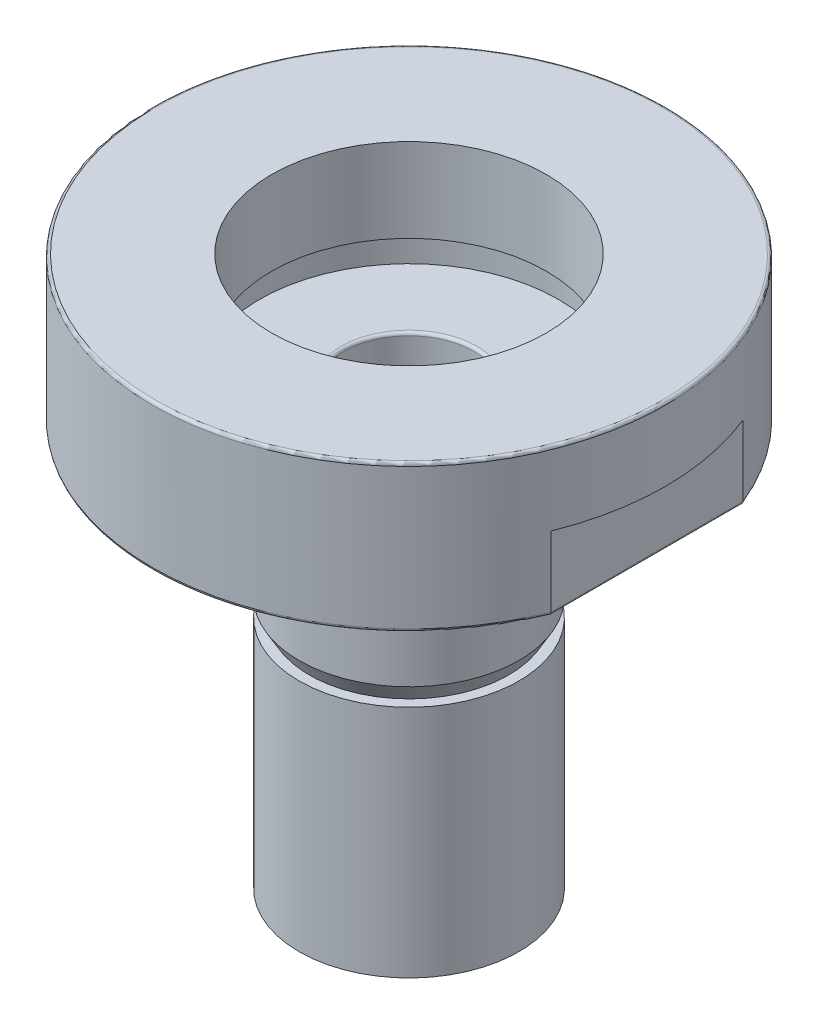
ISO-10303-21;
HEADER;
FILE_DESCRIPTION(('STEP AP214'),'2;1');
FILE_NAME('part.step','',(''),(''),'','','');
FILE_SCHEMA(('AUTOMOTIVE_DESIGN { 1 0 10303 214 1 1 1 1 }'));
ENDSEC;
DATA;
#1=APPLICATION_CONTEXT('core data for automotive mechanical design processes');
#2=APPLICATION_PROTOCOL_DEFINITION('international standard','automotive_design',2000,#1);
#3=PRODUCT_CONTEXT('',#1,'mechanical');
#4=PRODUCT('Part','Part','',(#3));
#5=PRODUCT_RELATED_PRODUCT_CATEGORY('part','',(#4));
#6=PRODUCT_DEFINITION_FORMATION('','',#4);
#7=PRODUCT_DEFINITION_CONTEXT('part definition',#1,'design');
#8=PRODUCT_DEFINITION('design','',#6,#7);
#9=PRODUCT_DEFINITION_SHAPE('','',#8);
#10=(LENGTH_UNIT() NAMED_UNIT(*) SI_UNIT(.MILLI.,.METRE.));
#11=(NAMED_UNIT(*) PLANE_ANGLE_UNIT() SI_UNIT($,.RADIAN.));
#12=(NAMED_UNIT(*) SI_UNIT($,.STERADIAN.) SOLID_ANGLE_UNIT());
#13=UNCERTAINTY_MEASURE_WITH_UNIT(LENGTH_MEASURE(1.E-05),#10,'distance_accuracy_value','');
#14=(GEOMETRIC_REPRESENTATION_CONTEXT(3) GLOBAL_UNCERTAINTY_ASSIGNED_CONTEXT((#13)) GLOBAL_UNIT_ASSIGNED_CONTEXT((#10,
#11,#12)) REPRESENTATION_CONTEXT('',''));
#15=CARTESIAN_POINT('',(0.,0.,0.));
#16=DIRECTION('',(0.,0.,1.));
#17=DIRECTION('',(1.,0.,0.));
#18=AXIS2_PLACEMENT_3D('',#15,#16,#17);
#19=CARTESIAN_POINT('',(0.,38.6460191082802,0.));
#20=DIRECTION('',(0.,1.,0.));
#21=DIRECTION('',(0.,0.,1.));
#22=AXIS2_PLACEMENT_3D('',#19,#20,#21);
#23=CYLINDRICAL_SURFACE('',#22,9.525);
#24=CARTESIAN_POINT('',(0.,-34.925,0.));
#25=DIRECTION('',(0.,1.,0.));
#26=DIRECTION('',(0.,0.,1.));
#27=AXIS2_PLACEMENT_3D('',#24,#25,#26);
#28=CIRCLE('',#27,9.52499999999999);
#29=CARTESIAN_POINT('',(0.,-34.925,9.52499999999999));
#30=VERTEX_POINT('',#29);
#31=EDGE_CURVE('E138',#30,#30,#28,.T.);
#32=ORIENTED_EDGE('',*,*,#31,.T.);
#33=EDGE_LOOP('',(#32));
#34=FACE_BOUND('',#33,.T.);
#35=CARTESIAN_POINT('',(0.,-14.605,0.));
#36=DIRECTION('',(0.,1.,0.));
#37=DIRECTION('',(0.,0.,1.));
#38=AXIS2_PLACEMENT_3D('',#35,#36,#37);
#39=CIRCLE('',#38,9.525);
#40=CARTESIAN_POINT('',(0.,-14.605,9.525));
#41=VERTEX_POINT('',#40);
#42=EDGE_CURVE('E40',#41,#41,#39,.F.);
#43=ORIENTED_EDGE('',*,*,#42,.T.);
#44=EDGE_LOOP('',(#43));
#45=FACE_BOUND('',#44,.T.);
#46=ADVANCED_FACE('F36',(#34,#45),#23,.T.);
#47=CARTESIAN_POINT('',(0.,-3.429,0.));
#48=DIRECTION('',(0.,-1.,0.));
#49=DIRECTION('',(0.,0.,-1.));
#50=AXIS2_PLACEMENT_3D('',#47,#48,#49);
#51=CIRCLE('',#50,9.525);
#52=CARTESIAN_POINT('',(0.,-3.429,-9.525));
#53=VERTEX_POINT('',#52);
#54=EDGE_CURVE('E203',#53,#53,#51,.T.);
#55=ORIENTED_EDGE('',*,*,#54,.T.);
#56=EDGE_LOOP('',(#55));
#57=FACE_BOUND('',#56,.T.);
#58=CARTESIAN_POINT('',(0.,-13.0696062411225,0.));
#59=DIRECTION('',(0.,-1.,0.));
#60=DIRECTION('',(0.,0.,-1.));
#61=AXIS2_PLACEMENT_3D('',#58,#59,#60);
#62=CIRCLE('',#61,9.525);
#63=CARTESIAN_POINT('',(0.,-13.0696062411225,-9.525));
#64=VERTEX_POINT('',#63);
#65=EDGE_CURVE('E673',#64,#64,#62,.T.);
#66=ORIENTED_EDGE('',*,*,#65,.F.);
#67=EDGE_LOOP('',(#66));
#68=FACE_BOUND('',#67,.T.);
#69=ADVANCED_FACE('F278',(#57,#68),#23,.T.);
#70=CARTESIAN_POINT('',(0.,0.,22.225));
#71=DIRECTION('',(0.,-1.,0.));
#72=DIRECTION('',(0.,0.,-1.));
#73=AXIS2_PLACEMENT_3D('',#70,#71,#72);
#74=PLANE('',#73);
#75=CARTESIAN_POINT('',(0.,0.,0.));
#76=DIRECTION('',(0.,-1.,0.));
#77=DIRECTION('',(0.,0.,-1.));
#78=AXIS2_PLACEMENT_3D('',#75,#76,#77);
#79=CIRCLE('',#78,21.971);
#80=CARTESIAN_POINT('',(-20.3581,0.,-8.26272384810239));
#81=VERTEX_POINT('',#80);
#82=CARTESIAN_POINT('',(20.3581,0.,-8.26272384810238));
#83=VERTEX_POINT('',#82);
#84=EDGE_CURVE('E176',#81,#83,#79,.T.);
#85=ORIENTED_EDGE('',*,*,#84,.T.);
#86=DIRECTION('',(0.,0.,-1.));
#87=VECTOR('',#86,1.);
#88=CARTESIAN_POINT('',(20.3581,0.,8.31215727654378));
#89=LINE('',#88,#87);
#90=CARTESIAN_POINT('',(20.3581,0.,8.26272384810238));
#91=VERTEX_POINT('',#90);
#92=EDGE_CURVE('E181',#83,#91,#89,.F.);
#93=ORIENTED_EDGE('',*,*,#92,.T.);
#94=CARTESIAN_POINT('',(0.,0.,0.));
#95=DIRECTION('',(0.,-1.,0.));
#96=DIRECTION('',(0.,0.,-1.));
#97=AXIS2_PLACEMENT_3D('',#94,#95,#96);
#98=CIRCLE('',#97,21.971);
#99=CARTESIAN_POINT('',(-20.3581,0.,8.26272384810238));
#100=VERTEX_POINT('',#99);
#101=EDGE_CURVE('E60',#91,#100,#98,.T.);
#102=ORIENTED_EDGE('',*,*,#101,.T.);
#103=DIRECTION('',(0.,0.,1.));
#104=VECTOR('',#103,1.);
#105=CARTESIAN_POINT('',(-20.3581,0.,-8.31215727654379));
#106=LINE('',#105,#104);
#107=EDGE_CURVE('E178',#100,#81,#106,.F.);
#108=ORIENTED_EDGE('',*,*,#107,.T.);
#109=EDGE_LOOP('',(#85,#93,#102,#108));
#110=FACE_BOUND('',#109,.T.);
#111=CARTESIAN_POINT('',(0.,0.,0.));
#112=DIRECTION('',(0.,-1.,0.));
#113=DIRECTION('',(0.,0.,-1.));
#114=AXIS2_PLACEMENT_3D('',#111,#112,#113);
#115=CIRCLE('',#114,17.8308);
#116=CARTESIAN_POINT('',(0.,0.,-17.8308));
#117=VERTEX_POINT('',#116);
#118=EDGE_CURVE('E147',#117,#117,#115,.F.);
#119=ORIENTED_EDGE('',*,*,#118,.T.);
#120=EDGE_LOOP('',(#119));
#121=FACE_BOUND('',#120,.T.);
#122=ADVANCED_FACE('F284',(#110,#121),#74,.T.);
#123=CARTESIAN_POINT('',(0.,0.,0.));
#124=DIRECTION('',(0.,-1.,0.));
#125=DIRECTION('',(0.,0.,-1.));
#126=AXIS2_PLACEMENT_3D('',#123,#124,#125);
#127=CIRCLE('',#126,8.80491);
#128=CARTESIAN_POINT('',(0.,0.,-8.80491));
#129=VERTEX_POINT('',#128);
#130=EDGE_CURVE('E11',#129,#129,#127,.F.);
#131=ORIENTED_EDGE('',*,*,#130,.T.);
#132=EDGE_LOOP('',(#131));
#133=FACE_BOUND('',#132,.T.);
#134=CARTESIAN_POINT('',(0.,0.,0.));
#135=DIRECTION('',(0.,-1.,0.));
#136=DIRECTION('',(0.,0.,-1.));
#137=AXIS2_PLACEMENT_3D('',#134,#135,#136);
#138=CIRCLE('',#137,14.6812);
#139=CARTESIAN_POINT('',(0.,0.,-14.6812));
#140=VERTEX_POINT('',#139);
#141=EDGE_CURVE('E150',#140,#140,#138,.T.);
#142=ORIENTED_EDGE('',*,*,#141,.T.);
#143=EDGE_LOOP('',(#142));
#144=FACE_BOUND('',#143,.T.);
#145=ADVANCED_FACE('F293',(#133,#144),#74,.T.);
#146=CARTESIAN_POINT('',(0.,2.794,0.));
#147=DIRECTION('',(0.,1.,0.));
#148=DIRECTION('',(0.,0.,1.));
#149=AXIS2_PLACEMENT_3D('',#146,#147,#148);
#150=CYLINDRICAL_SURFACE('',#149,11.90625);
#151=CARTESIAN_POINT('',(0.,12.7,0.));
#152=DIRECTION('',(0.,1.,0.));
#153=DIRECTION('',(0.,0.,1.));
#154=AXIS2_PLACEMENT_3D('',#151,#152,#153);
#155=CIRCLE('',#154,11.90625);
#156=CARTESIAN_POINT('',(0.,12.7,11.90625));
#157=VERTEX_POINT('',#156);
#158=EDGE_CURVE('E135',#157,#157,#155,.T.);
#159=ORIENTED_EDGE('',*,*,#158,.T.);
#160=EDGE_LOOP('',(#159));
#161=FACE_BOUND('',#160,.T.);
#162=CARTESIAN_POINT('',(0.,5.4356,0.));
#163=DIRECTION('',(0.,-1.,0.));
#164=DIRECTION('',(0.,0.,-1.));
#165=AXIS2_PLACEMENT_3D('',#162,#163,#164);
#166=CIRCLE('',#165,11.90625);
#167=CARTESIAN_POINT('',(0.,5.4356,-11.90625));
#168=VERTEX_POINT('',#167);
#169=EDGE_CURVE('E132',#168,#168,#166,.T.);
#170=ORIENTED_EDGE('',*,*,#169,.T.);
#171=EDGE_LOOP('',(#170));
#172=FACE_BOUND('',#171,.T.);
#173=ADVANCED_FACE('F330',(#161,#172),#150,.F.);
#174=CARTESIAN_POINT('',(0.,12.7,0.));
#175=DIRECTION('',(0.,-1.,0.));
#176=DIRECTION('',(0.,0.,-1.));
#177=AXIS2_PLACEMENT_3D('',#174,#175,#176);
#178=CYLINDRICAL_SURFACE('',#177,5.6515);
#179=CARTESIAN_POINT('',(0.,-34.671,0.));
#180=DIRECTION('',(0.,-1.,0.));
#181=DIRECTION('',(0.,0.,-1.));
#182=AXIS2_PLACEMENT_3D('',#179,#180,#181);
#183=CIRCLE('',#182,5.6515);
#184=CARTESIAN_POINT('',(0.,-34.671,-5.6515));
#185=VERTEX_POINT('',#184);
#186=EDGE_CURVE('E188',#185,#185,#183,.T.);
#187=ORIENTED_EDGE('',*,*,#186,.T.);
#188=EDGE_LOOP('',(#187));
#189=FACE_BOUND('',#188,.T.);
#190=CARTESIAN_POINT('',(0.,2.54,0.));
#191=DIRECTION('',(0.,1.,0.));
#192=DIRECTION('',(0.,0.,1.));
#193=AXIS2_PLACEMENT_3D('',#190,#191,#192);
#194=CIRCLE('',#193,5.6515);
#195=CARTESIAN_POINT('',(0.,2.54,5.6515));
#196=VERTEX_POINT('',#195);
#197=EDGE_CURVE('E185',#196,#196,#194,.T.);
#198=ORIENTED_EDGE('',*,*,#197,.T.);
#199=EDGE_LOOP('',(#198));
#200=FACE_BOUND('',#199,.T.);
#201=ADVANCED_FACE('F300',(#189,#200),#178,.F.);
#202=CARTESIAN_POINT('',(0.,12.7,0.));
#203=DIRECTION('',(0.,1.,0.));
#204=DIRECTION('',(0.,0.,1.));
#205=AXIS2_PLACEMENT_3D('',#202,#203,#204);
#206=PLANE('',#205);
#207=CARTESIAN_POINT('',(0.,12.7,0.));
#208=DIRECTION('',(0.,1.,0.));
#209=DIRECTION('',(0.,0.,1.));
#210=AXIS2_PLACEMENT_3D('',#207,#208,#209);
#211=CIRCLE('',#210,21.971);
#212=CARTESIAN_POINT('',(0.,12.7,21.971));
#213=VERTEX_POINT('',#212);
#214=EDGE_CURVE('E165',#213,#213,#211,.T.);
#215=ORIENTED_EDGE('',*,*,#214,.T.);
#216=EDGE_LOOP('',(#215));
#217=FACE_BOUND('',#216,.T.);
#218=ORIENTED_EDGE('',*,*,#158,.F.);
#219=EDGE_LOOP('',(#218));
#220=FACE_BOUND('',#219,.T.);
#221=ADVANCED_FACE('F296',(#217,#220),#206,.T.);
#222=CARTESIAN_POINT('',(0.,38.6460191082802,0.));
#223=DIRECTION('',(0.,1.,0.));
#224=DIRECTION('',(0.,0.,1.));
#225=AXIS2_PLACEMENT_3D('',#222,#223,#224);
#226=CYLINDRICAL_SURFACE('',#225,22.225);
#227=CARTESIAN_POINT('',(0.,12.446,0.));
#228=DIRECTION('',(0.,1.,0.));
#229=DIRECTION('',(0.,0.,1.));
#230=AXIS2_PLACEMENT_3D('',#227,#228,#229);
#231=CIRCLE('',#230,22.225);
#232=CARTESIAN_POINT('',(0.,12.446,22.225));
#233=VERTEX_POINT('',#232);
#234=EDGE_CURVE('E171',#233,#233,#231,.F.);
#235=ORIENTED_EDGE('',*,*,#234,.T.);
#236=EDGE_LOOP('',(#235));
#237=FACE_BOUND('',#236,.T.);
#238=DIRECTION('',(0.,1.,0.));
#239=VECTOR('',#238,1.);
#240=CARTESIAN_POINT('',(-20.6121,38.6460191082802,8.31215727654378));
#241=LINE('',#240,#239);
#242=CARTESIAN_POINT('',(-20.6121,0.253999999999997,8.31215727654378));
#243=VERTEX_POINT('',#242);
#244=CARTESIAN_POINT('',(-20.6121,6.35,8.31215727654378));
#245=VERTEX_POINT('',#244);
#246=EDGE_CURVE('E118',#243,#245,#241,.T.);
#247=ORIENTED_EDGE('',*,*,#246,.F.);
#248=CARTESIAN_POINT('',(0.,0.253999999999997,0.));
#249=DIRECTION('',(0.,-1.,0.));
#250=DIRECTION('',(0.,0.,-1.));
#251=AXIS2_PLACEMENT_3D('',#248,#249,#250);
#252=CIRCLE('',#251,22.225);
#253=CARTESIAN_POINT('',(20.6121,0.253999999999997,8.31215727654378));
#254=VERTEX_POINT('',#253);
#255=EDGE_CURVE('E114',#243,#254,#252,.F.);
#256=ORIENTED_EDGE('',*,*,#255,.T.);
#257=DIRECTION('',(0.,1.,0.));
#258=VECTOR('',#257,1.);
#259=CARTESIAN_POINT('',(20.6121,38.6460191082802,8.31215727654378));
#260=LINE('',#259,#258);
#261=CARTESIAN_POINT('',(20.6121,6.35,8.31215727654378));
#262=VERTEX_POINT('',#261);
#263=EDGE_CURVE('E107',#262,#254,#260,.F.);
#264=ORIENTED_EDGE('',*,*,#263,.F.);
#265=CARTESIAN_POINT('',(0.,6.35,0.));
#266=DIRECTION('',(0.,1.,0.));
#267=DIRECTION('',(0.,0.,1.));
#268=AXIS2_PLACEMENT_3D('',#265,#266,#267);
#269=CIRCLE('',#268,22.225);
#270=CARTESIAN_POINT('',(20.6121,6.35,-8.31215727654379));
#271=VERTEX_POINT('',#270);
#272=EDGE_CURVE('E93',#271,#262,#269,.F.);
#273=ORIENTED_EDGE('',*,*,#272,.F.);
#274=DIRECTION('',(0.,1.,0.));
#275=VECTOR('',#274,1.);
#276=CARTESIAN_POINT('',(20.6121,38.6460191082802,-8.31215727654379));
#277=LINE('',#276,#275);
#278=CARTESIAN_POINT('',(20.6121,0.253999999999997,-8.31215727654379));
#279=VERTEX_POINT('',#278);
#280=EDGE_CURVE('E108',#279,#271,#277,.T.);
#281=ORIENTED_EDGE('',*,*,#280,.F.);
#282=CARTESIAN_POINT('',(0.,0.253999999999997,0.));
#283=DIRECTION('',(0.,-1.,0.));
#284=DIRECTION('',(0.,0.,-1.));
#285=AXIS2_PLACEMENT_3D('',#282,#283,#284);
#286=CIRCLE('',#285,22.225);
#287=CARTESIAN_POINT('',(-20.6121,0.253999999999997,-8.31215727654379));
#288=VERTEX_POINT('',#287);
#289=EDGE_CURVE('E168',#279,#288,#286,.F.);
#290=ORIENTED_EDGE('',*,*,#289,.T.);
#291=DIRECTION('',(0.,1.,0.));
#292=VECTOR('',#291,1.);
#293=CARTESIAN_POINT('',(-20.6121,38.6460191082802,-8.31215727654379));
#294=LINE('',#293,#292);
#295=CARTESIAN_POINT('',(-20.6121,6.35,-8.31215727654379));
#296=VERTEX_POINT('',#295);
#297=EDGE_CURVE('E123',#296,#288,#294,.F.);
#298=ORIENTED_EDGE('',*,*,#297,.F.);
#299=CARTESIAN_POINT('',(0.,6.35,0.));
#300=DIRECTION('',(0.,1.,0.));
#301=DIRECTION('',(0.,0.,1.));
#302=AXIS2_PLACEMENT_3D('',#299,#300,#301);
#303=CIRCLE('',#302,22.225);
#304=EDGE_CURVE('E101',#245,#296,#303,.F.);
#305=ORIENTED_EDGE('',*,*,#304,.F.);
#306=EDGE_LOOP('',(#247,#256,#264,#273,#281,#290,#298,#305));
#307=FACE_BOUND('',#306,.T.);
#308=ADVANCED_FACE('F112',(#237,#307),#226,.T.);
#309=CARTESIAN_POINT('',(0.,-34.925,9.52499999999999));
#310=DIRECTION('',(0.,-1.,0.));
#311=DIRECTION('',(0.,0.,-1.));
#312=AXIS2_PLACEMENT_3D('',#309,#310,#311);
#313=PLANE('',#312);
#314=CARTESIAN_POINT('',(0.,-34.925,0.));
#315=DIRECTION('',(0.,-1.,0.));
#316=DIRECTION('',(0.,0.,-1.));
#317=AXIS2_PLACEMENT_3D('',#314,#315,#316);
#318=CIRCLE('',#317,5.9055);
#319=CARTESIAN_POINT('',(0.,-34.925,-5.9055));
#320=VERTEX_POINT('',#319);
#321=EDGE_CURVE('E191',#320,#320,#318,.F.);
#322=ORIENTED_EDGE('',*,*,#321,.T.);
#323=EDGE_LOOP('',(#322));
#324=FACE_BOUND('',#323,.T.);
#325=ORIENTED_EDGE('',*,*,#31,.F.);
#326=EDGE_LOOP('',(#325));
#327=FACE_BOUND('',#326,.T.);
#328=ADVANCED_FACE('F289',(#324,#327),#313,.T.);
#329=CARTESIAN_POINT('',(0.,2.794,0.));
#330=DIRECTION('',(0.,1.,0.));
#331=DIRECTION('',(0.,0.,1.));
#332=AXIS2_PLACEMENT_3D('',#329,#330,#331);
#333=PLANE('',#332);
#334=CARTESIAN_POINT('',(0.,2.794,0.));
#335=DIRECTION('',(0.,1.,0.));
#336=DIRECTION('',(0.,0.,1.));
#337=AXIS2_PLACEMENT_3D('',#334,#335,#336);
#338=CIRCLE('',#337,5.9055);
#339=CARTESIAN_POINT('',(0.,2.794,5.9055));
#340=VERTEX_POINT('',#339);
#341=EDGE_CURVE('E194',#340,#340,#338,.F.);
#342=ORIENTED_EDGE('',*,*,#341,.T.);
#343=EDGE_LOOP('',(#342));
#344=FACE_BOUND('',#343,.T.);
#345=CARTESIAN_POINT('',(0.,2.794,0.));
#346=DIRECTION('',(0.,-1.,0.));
#347=DIRECTION('',(0.,0.,-1.));
#348=AXIS2_PLACEMENT_3D('',#345,#346,#347);
#349=CIRCLE('',#348,12.954);
#350=CARTESIAN_POINT('',(0.,2.794,-12.954));
#351=VERTEX_POINT('',#350);
#352=EDGE_CURVE('E126',#351,#351,#349,.T.);
#353=ORIENTED_EDGE('',*,*,#352,.F.);
#354=EDGE_LOOP('',(#353));
#355=FACE_BOUND('',#354,.T.);
#356=ADVANCED_FACE('F339',(#344,#355),#333,.T.);
#357=CARTESIAN_POINT('',(0.,5.4356,11.90625));
#358=DIRECTION('',(0.,-1.,0.));
#359=DIRECTION('',(0.,0.,-1.));
#360=AXIS2_PLACEMENT_3D('',#357,#358,#359);
#361=PLANE('',#360);
#362=CARTESIAN_POINT('',(0.,5.4356,0.));
#363=DIRECTION('',(0.,-1.,0.));
#364=DIRECTION('',(0.,0.,-1.));
#365=AXIS2_PLACEMENT_3D('',#362,#363,#364);
#366=CIRCLE('',#365,12.954);
#367=CARTESIAN_POINT('',(0.,5.4356,-12.954));
#368=VERTEX_POINT('',#367);
#369=EDGE_CURVE('E129',#368,#368,#366,.T.);
#370=ORIENTED_EDGE('',*,*,#369,.T.);
#371=EDGE_LOOP('',(#370));
#372=FACE_BOUND('',#371,.T.);
#373=ORIENTED_EDGE('',*,*,#169,.F.);
#374=EDGE_LOOP('',(#373));
#375=FACE_BOUND('',#374,.T.);
#376=ADVANCED_FACE('F336',(#372,#375),#361,.T.);
#377=CARTESIAN_POINT('',(0.,0.,0.));
#378=DIRECTION('',(0.,-1.,0.));
#379=DIRECTION('',(0.,0.,-1.));
#380=AXIS2_PLACEMENT_3D('',#377,#378,#379);
#381=CYLINDRICAL_SURFACE('',#380,12.954);
#382=ORIENTED_EDGE('',*,*,#352,.T.);
#383=EDGE_LOOP('',(#382));
#384=FACE_BOUND('',#383,.T.);
#385=ORIENTED_EDGE('',*,*,#369,.F.);
#386=EDGE_LOOP('',(#385));
#387=FACE_BOUND('',#386,.T.);
#388=ADVANCED_FACE('F338',(#384,#387),#381,.F.);
#389=CARTESIAN_POINT('',(-9.525,-3.175,0.));
#390=DIRECTION('',(0.,-1.,0.));
#391=DIRECTION('',(0.,0.,-1.));
#392=AXIS2_PLACEMENT_3D('',#389,#390,#391);
#393=PLANE('',#392);
#394=CARTESIAN_POINT('',(0.,-3.175,0.));
#395=DIRECTION('',(0.,-1.,0.));
#396=DIRECTION('',(0.,0.,-1.));
#397=AXIS2_PLACEMENT_3D('',#394,#395,#396);
#398=CIRCLE('',#397,9.271);
#399=CARTESIAN_POINT('',(0.,-3.175,-9.271));
#400=VERTEX_POINT('',#399);
#401=EDGE_CURVE('E200',#400,#400,#398,.F.);
#402=ORIENTED_EDGE('',*,*,#401,.T.);
#403=EDGE_LOOP('',(#402));
#404=FACE_BOUND('',#403,.T.);
#405=CARTESIAN_POINT('',(0.,-3.175,0.));
#406=DIRECTION('',(0.,-1.,0.));
#407=DIRECTION('',(0.,0.,-1.));
#408=AXIS2_PLACEMENT_3D('',#405,#406,#407);
#409=CIRCLE('',#408,8.80491);
#410=CARTESIAN_POINT('',(0.,-3.175,-8.80491));
#411=VERTEX_POINT('',#410);
#412=EDGE_CURVE('E197',#411,#411,#409,.T.);
#413=ORIENTED_EDGE('',*,*,#412,.T.);
#414=EDGE_LOOP('',(#413));
#415=FACE_BOUND('',#414,.T.);
#416=ADVANCED_FACE('F346',(#404,#415),#393,.F.);
#417=CARTESIAN_POINT('',(0.,0.,0.));
#418=DIRECTION('',(0.,1.,0.));
#419=DIRECTION('',(0.,0.,1.));
#420=AXIS2_PLACEMENT_3D('',#417,#418,#419);
#421=CYLINDRICAL_SURFACE('',#420,8.55091);
#422=CARTESIAN_POINT('',(0.,-2.921,0.));
#423=DIRECTION('',(0.,-1.,0.));
#424=DIRECTION('',(0.,0.,-1.));
#425=AXIS2_PLACEMENT_3D('',#422,#423,#424);
#426=CIRCLE('',#425,8.55091);
#427=CARTESIAN_POINT('',(0.,-2.921,-8.55091));
#428=VERTEX_POINT('',#427);
#429=EDGE_CURVE('E45',#428,#428,#426,.F.);
#430=ORIENTED_EDGE('',*,*,#429,.T.);
#431=EDGE_LOOP('',(#430));
#432=FACE_BOUND('',#431,.T.);
#433=CARTESIAN_POINT('',(0.,-0.254,0.));
#434=DIRECTION('',(0.,-1.,0.));
#435=DIRECTION('',(0.,0.,-1.));
#436=AXIS2_PLACEMENT_3D('',#433,#434,#435);
#437=CIRCLE('',#436,8.55091);
#438=CARTESIAN_POINT('',(0.,-0.254,-8.55091));
#439=VERTEX_POINT('',#438);
#440=EDGE_CURVE('E206',#439,#439,#437,.T.);
#441=ORIENTED_EDGE('',*,*,#440,.T.);
#442=EDGE_LOOP('',(#441));
#443=FACE_BOUND('',#442,.T.);
#444=ADVANCED_FACE('F275',(#432,#443),#421,.T.);
#445=CARTESIAN_POINT('',(-20.6121,6.35,17.5456265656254));
#446=DIRECTION('',(1.,0.,0.));
#447=DIRECTION('',(0.,0.,-1.));
#448=AXIS2_PLACEMENT_3D('',#445,#446,#447);
#449=PLANE('',#448);
#450=ORIENTED_EDGE('',*,*,#297,.T.);
#451=DIRECTION('',(0.,0.,1.));
#452=VECTOR('',#451,1.);
#453=CARTESIAN_POINT('',(-20.6121,0.254,8.31215727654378));
#454=LINE('',#453,#452);
#455=EDGE_CURVE('E183',#288,#243,#454,.T.);
#456=ORIENTED_EDGE('',*,*,#455,.T.);
#457=ORIENTED_EDGE('',*,*,#246,.T.);
#458=DIRECTION('',(0.,0.,1.));
#459=VECTOR('',#458,1.);
#460=CARTESIAN_POINT('',(-20.6121,6.35,17.5456265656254));
#461=LINE('',#460,#459);
#462=EDGE_CURVE('E115',#296,#245,#461,.T.);
#463=ORIENTED_EDGE('',*,*,#462,.F.);
#464=EDGE_LOOP('',(#450,#456,#457,#463));
#465=FACE_BOUND('',#464,.T.);
#466=ADVANCED_FACE('F262',(#465),#449,.F.);
#467=CARTESIAN_POINT('',(0.,6.35,0.));
#468=DIRECTION('',(0.,1.,0.));
#469=DIRECTION('',(0.,0.,1.));
#470=AXIS2_PLACEMENT_3D('',#467,#468,#469);
#471=PLANE('',#470);
#472=ORIENTED_EDGE('',*,*,#304,.T.);
#473=ORIENTED_EDGE('',*,*,#462,.T.);
#474=EDGE_LOOP('',(#472,#473));
#475=FACE_BOUND('',#474,.T.);
#476=ADVANCED_FACE('F267',(#475),#471,.F.);
#477=CARTESIAN_POINT('',(20.6121,6.35,17.5456265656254));
#478=DIRECTION('',(-1.,0.,0.));
#479=DIRECTION('',(0.,0.,1.));
#480=AXIS2_PLACEMENT_3D('',#477,#478,#479);
#481=PLANE('',#480);
#482=ORIENTED_EDGE('',*,*,#263,.T.);
#483=DIRECTION('',(0.,0.,-1.));
#484=VECTOR('',#483,1.);
#485=CARTESIAN_POINT('',(20.6121,0.254,-8.31215727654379));
#486=LINE('',#485,#484);
#487=EDGE_CURVE('E174',#254,#279,#486,.T.);
#488=ORIENTED_EDGE('',*,*,#487,.T.);
#489=ORIENTED_EDGE('',*,*,#280,.T.);
#490=DIRECTION('',(0.,0.,-1.));
#491=VECTOR('',#490,1.);
#492=CARTESIAN_POINT('',(20.6121,6.35,17.5456265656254));
#493=LINE('',#492,#491);
#494=EDGE_CURVE('E96',#262,#271,#493,.T.);
#495=ORIENTED_EDGE('',*,*,#494,.F.);
#496=EDGE_LOOP('',(#482,#488,#489,#495));
#497=FACE_BOUND('',#496,.T.);
#498=ADVANCED_FACE('F105',(#497),#481,.F.);
#499=CARTESIAN_POINT('',(0.,6.35,0.));
#500=DIRECTION('',(0.,1.,0.));
#501=DIRECTION('',(0.,0.,1.));
#502=AXIS2_PLACEMENT_3D('',#499,#500,#501);
#503=PLANE('',#502);
#504=ORIENTED_EDGE('',*,*,#272,.T.);
#505=ORIENTED_EDGE('',*,*,#494,.T.);
#506=EDGE_LOOP('',(#504,#505));
#507=FACE_BOUND('',#506,.T.);
#508=ADVANCED_FACE('F95',(#507),#503,.F.);
#509=CARTESIAN_POINT('',(0.,0.,0.));
#510=DIRECTION('',(0.,-1.,0.));
#511=DIRECTION('',(0.,0.,-1.));
#512=AXIS2_PLACEMENT_3D('',#509,#510,#511);
#513=CYLINDRICAL_SURFACE('',#512,17.5768);
#514=CARTESIAN_POINT('',(0.,0.254,0.));
#515=DIRECTION('',(0.,-1.,0.));
#516=DIRECTION('',(0.,0.,-1.));
#517=AXIS2_PLACEMENT_3D('',#514,#515,#516);
#518=CIRCLE('',#517,17.5768);
#519=CARTESIAN_POINT('',(0.,0.254,-17.5768));
#520=VERTEX_POINT('',#519);
#521=EDGE_CURVE('E144',#520,#520,#518,.T.);
#522=ORIENTED_EDGE('',*,*,#521,.T.);
#523=EDGE_LOOP('',(#522));
#524=FACE_BOUND('',#523,.T.);
#525=CARTESIAN_POINT('',(0.,1.0668,0.));
#526=DIRECTION('',(0.,-1.,0.));
#527=DIRECTION('',(0.,0.,-1.));
#528=AXIS2_PLACEMENT_3D('',#525,#526,#527);
#529=CIRCLE('',#528,17.5768);
#530=CARTESIAN_POINT('',(0.,1.0668,-17.5768));
#531=VERTEX_POINT('',#530);
#532=EDGE_CURVE('E100',#531,#531,#529,.F.);
#533=ORIENTED_EDGE('',*,*,#532,.T.);
#534=EDGE_LOOP('',(#533));
#535=FACE_BOUND('',#534,.T.);
#536=ADVANCED_FACE('F459',(#524,#535),#513,.F.);
#537=CARTESIAN_POINT('',(-17.5768,1.3208,0.));
#538=DIRECTION('',(0.,-1.,0.));
#539=DIRECTION('',(0.,0.,-1.));
#540=AXIS2_PLACEMENT_3D('',#537,#538,#539);
#541=PLANE('',#540);
#542=CARTESIAN_POINT('',(0.,1.3208,0.));
#543=DIRECTION('',(0.,-1.,0.));
#544=DIRECTION('',(0.,0.,-1.));
#545=AXIS2_PLACEMENT_3D('',#542,#543,#544);
#546=CIRCLE('',#545,15.1892);
#547=CARTESIAN_POINT('',(0.,1.3208,-15.1892));
#548=VERTEX_POINT('',#547);
#549=EDGE_CURVE('E162',#548,#548,#546,.F.);
#550=ORIENTED_EDGE('',*,*,#549,.T.);
#551=EDGE_LOOP('',(#550));
#552=FACE_BOUND('',#551,.T.);
#553=CARTESIAN_POINT('',(0.,1.3208,0.));
#554=DIRECTION('',(0.,-1.,0.));
#555=DIRECTION('',(0.,0.,-1.));
#556=AXIS2_PLACEMENT_3D('',#553,#554,#555);
#557=CIRCLE('',#556,17.3228);
#558=CARTESIAN_POINT('',(0.,1.3208,-17.3228));
#559=VERTEX_POINT('',#558);
#560=EDGE_CURVE('E159',#559,#559,#557,.T.);
#561=ORIENTED_EDGE('',*,*,#560,.T.);
#562=EDGE_LOOP('',(#561));
#563=FACE_BOUND('',#562,.T.);
#564=ADVANCED_FACE('F455',(#552,#563),#541,.T.);
#565=CARTESIAN_POINT('',(0.,0.,0.));
#566=DIRECTION('',(0.,-1.,0.));
#567=DIRECTION('',(0.,0.,-1.));
#568=AXIS2_PLACEMENT_3D('',#565,#566,#567);
#569=CYLINDRICAL_SURFACE('',#568,14.9352);
#570=CARTESIAN_POINT('',(0.,0.254,0.));
#571=DIRECTION('',(0.,-1.,0.));
#572=DIRECTION('',(0.,0.,-1.));
#573=AXIS2_PLACEMENT_3D('',#570,#571,#572);
#574=CIRCLE('',#573,14.9352);
#575=CARTESIAN_POINT('',(0.,0.254,-14.9352));
#576=VERTEX_POINT('',#575);
#577=EDGE_CURVE('E156',#576,#576,#574,.F.);
#578=ORIENTED_EDGE('',*,*,#577,.T.);
#579=EDGE_LOOP('',(#578));
#580=FACE_BOUND('',#579,.T.);
#581=CARTESIAN_POINT('',(0.,1.0668,0.));
#582=DIRECTION('',(0.,-1.,0.));
#583=DIRECTION('',(0.,0.,-1.));
#584=AXIS2_PLACEMENT_3D('',#581,#582,#583);
#585=CIRCLE('',#584,14.9352);
#586=CARTESIAN_POINT('',(0.,1.0668,-14.9352));
#587=VERTEX_POINT('',#586);
#588=EDGE_CURVE('E153',#587,#587,#585,.T.);
#589=ORIENTED_EDGE('',*,*,#588,.T.);
#590=EDGE_LOOP('',(#589));
#591=FACE_BOUND('',#590,.T.);
#592=ADVANCED_FACE('F306',(#580,#591),#569,.T.);
#593=CARTESIAN_POINT('',(0.,0.254,0.));
#594=DIRECTION('',(0.,-1.,0.));
#595=DIRECTION('',(0.,0.,-1.));
#596=AXIS2_PLACEMENT_3D('',#593,#594,#595);
#597=TOROIDAL_SURFACE('',#596,17.8308,0.254);
#598=ORIENTED_EDGE('',*,*,#118,.F.);
#599=EDGE_LOOP('',(#598));
#600=FACE_BOUND('',#599,.T.);
#601=ORIENTED_EDGE('',*,*,#521,.F.);
#602=EDGE_LOOP('',(#601));
#603=FACE_BOUND('',#602,.T.);
#604=ADVANCED_FACE('F302',(#600,#603),#597,.T.);
#605=CARTESIAN_POINT('',(0.,0.254,0.));
#606=DIRECTION('',(0.,-1.,0.));
#607=DIRECTION('',(0.,0.,-1.));
#608=AXIS2_PLACEMENT_3D('',#605,#606,#607);
#609=TOROIDAL_SURFACE('',#608,14.6812,0.254);
#610=ORIENTED_EDGE('',*,*,#577,.F.);
#611=EDGE_LOOP('',(#610));
#612=FACE_BOUND('',#611,.T.);
#613=ORIENTED_EDGE('',*,*,#141,.F.);
#614=EDGE_LOOP('',(#613));
#615=FACE_BOUND('',#614,.T.);
#616=ADVANCED_FACE('F305',(#612,#615),#609,.T.);
#617=CARTESIAN_POINT('',(0.,1.0668,0.));
#618=DIRECTION('',(0.,-1.,0.));
#619=DIRECTION('',(0.,0.,-1.));
#620=AXIS2_PLACEMENT_3D('',#617,#618,#619);
#621=TOROIDAL_SURFACE('',#620,15.1892,0.254);
#622=ORIENTED_EDGE('',*,*,#549,.F.);
#623=EDGE_LOOP('',(#622));
#624=FACE_BOUND('',#623,.T.);
#625=ORIENTED_EDGE('',*,*,#588,.F.);
#626=EDGE_LOOP('',(#625));
#627=FACE_BOUND('',#626,.T.);
#628=ADVANCED_FACE('F310',(#624,#627),#621,.F.);
#629=CARTESIAN_POINT('',(0.,1.0668,0.));
#630=DIRECTION('',(0.,-1.,0.));
#631=DIRECTION('',(0.,0.,-1.));
#632=AXIS2_PLACEMENT_3D('',#629,#630,#631);
#633=TOROIDAL_SURFACE('',#632,17.3228,0.254);
#634=ORIENTED_EDGE('',*,*,#532,.F.);
#635=EDGE_LOOP('',(#634));
#636=FACE_BOUND('',#635,.T.);
#637=ORIENTED_EDGE('',*,*,#560,.F.);
#638=EDGE_LOOP('',(#637));
#639=FACE_BOUND('',#638,.T.);
#640=ADVANCED_FACE('F314',(#636,#639),#633,.F.);
#641=CARTESIAN_POINT('',(0.,12.446,0.));
#642=DIRECTION('',(0.,1.,0.));
#643=DIRECTION('',(0.,0.,1.));
#644=AXIS2_PLACEMENT_3D('',#641,#642,#643);
#645=TOROIDAL_SURFACE('',#644,21.971,0.254);
#646=ORIENTED_EDGE('',*,*,#234,.F.);
#647=EDGE_LOOP('',(#646));
#648=FACE_BOUND('',#647,.T.);
#649=ORIENTED_EDGE('',*,*,#214,.F.);
#650=EDGE_LOOP('',(#649));
#651=FACE_BOUND('',#650,.T.);
#652=ADVANCED_FACE('F317',(#648,#651),#645,.T.);
#653=CARTESIAN_POINT('',(-20.3581,0.254,17.5456265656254));
#654=DIRECTION('',(0.,0.,-1.));
#655=DIRECTION('',(-1.,0.,0.));
#656=AXIS2_PLACEMENT_3D('',#653,#654,#655);
#657=CYLINDRICAL_SURFACE('',#656,0.254);
#658=CARTESIAN_POINT('',(-20.6121,0.253999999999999,-8.31215727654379));
#659=CARTESIAN_POINT('',(-20.6121129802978,0.239900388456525,-8.31215975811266));
#660=CARTESIAN_POINT('',(-20.6109268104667,0.225805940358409,-8.31192962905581));
#661=CARTESIAN_POINT('',(-20.606253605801,0.198035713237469,-8.31102278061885));
#662=CARTESIAN_POINT('',(-20.6027694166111,0.184359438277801,-8.31034661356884));
#663=CARTESIAN_POINT('',(-20.5935957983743,0.157793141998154,-8.30856597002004));
#664=CARTESIAN_POINT('',(-20.5879057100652,0.144903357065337,-8.30746136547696));
#665=CARTESIAN_POINT('',(-20.5745000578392,0.120270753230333,-8.30485824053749));
#666=CARTESIAN_POINT('',(-20.5667846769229,0.1085278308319,-8.30335975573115));
#667=CARTESIAN_POINT('',(-20.5494889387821,0.0864144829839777,-8.2999994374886));
#668=CARTESIAN_POINT('',(-20.5398943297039,0.0760556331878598,-8.2981348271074));
#669=CARTESIAN_POINT('',(-20.519157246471,0.0570886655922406,-8.29410320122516));
#670=CARTESIAN_POINT('',(-20.5080142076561,0.0484811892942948,-8.29193607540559));
#671=CARTESIAN_POINT('',(-20.4842918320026,0.0331040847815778,-8.2873204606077));
#672=CARTESIAN_POINT('',(-20.471690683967,0.0263694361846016,-8.28486769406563));
#673=CARTESIAN_POINT('',(-20.4455747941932,0.0151151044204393,-8.27978188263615));
#674=CARTESIAN_POINT('',(-20.432060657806,0.0105939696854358,-8.27714895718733));
#675=CARTESIAN_POINT('',(-20.4092570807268,0.00503100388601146,-8.27270397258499));
#676=CARTESIAN_POINT('',(-20.4001169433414,0.00332706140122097,-8.27092176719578));
#677=CARTESIAN_POINT('',(-20.38171946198,0.000931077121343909,-8.26733332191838));
#678=CARTESIAN_POINT('',(-20.3724623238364,0.00023745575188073,-8.26552712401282));
#679=CARTESIAN_POINT('',(-20.3615009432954,1.70407287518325E-05,-8.26338769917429));
#680=CARTESIAN_POINT('',(-20.3598003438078,-4.55862761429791E-08,-8.26305575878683));
#681=CARTESIAN_POINT('',(-20.3581,0.,-8.26272384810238));
#682=B_SPLINE_CURVE_WITH_KNOTS('',3,(#658,#659,#660,#661,#662,#663,#664,#665,#666,#667,#668,
#669,#670,#671,#672,#673,#674,#675,#676,#677,#678,#679,#680,#681),.UNSPECIFIED.,.F.,.F.,(4,2,2,
2,2,2,2,2,2,2,2,4),(0.,0.0422394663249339,0.0844267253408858,0.12662660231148,0.168822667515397,
0.211352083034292,0.253897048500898,0.297190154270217,0.340454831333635,0.368807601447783,
0.39711599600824,0.402313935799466),.UNSPECIFIED.);
#683=EDGE_CURVE('E247',#81,#288,#682,.F.);
#684=ORIENTED_EDGE('',*,*,#683,.F.);
#685=ORIENTED_EDGE('',*,*,#107,.F.);
#686=CARTESIAN_POINT('',(-20.6121,0.253999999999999,8.31215727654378));
#687=CARTESIAN_POINT('',(-20.6121129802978,0.239900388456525,8.31215975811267));
#688=CARTESIAN_POINT('',(-20.6109268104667,0.225805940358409,8.31192962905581));
#689=CARTESIAN_POINT('',(-20.606253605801,0.198035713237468,8.31102278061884));
#690=CARTESIAN_POINT('',(-20.6027694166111,0.184359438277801,8.31034661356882));
#691=CARTESIAN_POINT('',(-20.5935957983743,0.157793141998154,8.30856597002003));
#692=CARTESIAN_POINT('',(-20.5879057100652,0.144903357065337,8.30746136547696));
#693=CARTESIAN_POINT('',(-20.5745000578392,0.120270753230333,8.3048582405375));
#694=CARTESIAN_POINT('',(-20.5667846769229,0.1085278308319,8.30335975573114));
#695=CARTESIAN_POINT('',(-20.5494889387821,0.0864144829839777,8.29999943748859));
#696=CARTESIAN_POINT('',(-20.5398943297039,0.0760556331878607,8.29813482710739));
#697=CARTESIAN_POINT('',(-20.519157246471,0.0570886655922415,8.29410320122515));
#698=CARTESIAN_POINT('',(-20.5080142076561,0.0484811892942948,8.29193607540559));
#699=CARTESIAN_POINT('',(-20.4842918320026,0.0331040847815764,8.2873204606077));
#700=CARTESIAN_POINT('',(-20.471690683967,0.0263694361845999,8.28486769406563));
#701=CARTESIAN_POINT('',(-20.4455747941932,0.0151151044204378,8.27978188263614));
#702=CARTESIAN_POINT('',(-20.432060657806,0.0105939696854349,8.27714895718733));
#703=CARTESIAN_POINT('',(-20.4092570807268,0.00503100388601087,8.27270397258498));
#704=CARTESIAN_POINT('',(-20.4001169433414,0.00332706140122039,8.27092176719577));
#705=CARTESIAN_POINT('',(-20.38171946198,0.00093107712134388,8.26733332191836));
#706=CARTESIAN_POINT('',(-20.3724623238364,0.000237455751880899,8.26552712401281));
#707=CARTESIAN_POINT('',(-20.3615009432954,1.70407287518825E-05,8.26338769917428));
#708=CARTESIAN_POINT('',(-20.3598003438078,-4.55862761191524E-08,8.26305575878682));
#709=CARTESIAN_POINT('',(-20.3581,0.,8.26272384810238));
#710=B_SPLINE_CURVE_WITH_KNOTS('',3,(#686,#687,#688,#689,#690,#691,#692,#693,#694,#695,#696,
#697,#698,#699,#700,#701,#702,#703,#704,#705,#706,#707,#708,#709),.UNSPECIFIED.,.F.,.F.,(4,2,2,
2,2,2,2,2,2,2,2,4),(0.,0.0422394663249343,0.0844267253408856,0.126626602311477,
0.168822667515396,0.211352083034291,0.253897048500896,0.29719015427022,0.340454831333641,
0.36880760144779,0.397115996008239,0.402313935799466),.UNSPECIFIED.);
#711=EDGE_CURVE('E109',#243,#100,#710,.T.);
#712=ORIENTED_EDGE('',*,*,#711,.F.);
#713=ORIENTED_EDGE('',*,*,#455,.F.);
#714=EDGE_LOOP('',(#684,#685,#712,#713));
#715=FACE_BOUND('',#714,.T.);
#716=ADVANCED_FACE('F237',(#715),#657,.T.);
#717=CARTESIAN_POINT('',(0.,0.253999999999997,0.));
#718=DIRECTION('',(0.,-1.,0.));
#719=DIRECTION('',(0.,0.,-1.));
#720=AXIS2_PLACEMENT_3D('',#717,#718,#719);
#721=TOROIDAL_SURFACE('',#720,21.971,0.254);
#722=ORIENTED_EDGE('',*,*,#711,.T.);
#723=ORIENTED_EDGE('',*,*,#101,.F.);
#724=CARTESIAN_POINT('',(20.6121,0.253999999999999,8.31215727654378));
#725=CARTESIAN_POINT('',(20.6121129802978,0.239900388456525,8.31215975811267));
#726=CARTESIAN_POINT('',(20.6109268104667,0.225805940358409,8.31192962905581));
#727=CARTESIAN_POINT('',(20.606253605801,0.198035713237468,8.31102278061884));
#728=CARTESIAN_POINT('',(20.6027694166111,0.184359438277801,8.31034661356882));
#729=CARTESIAN_POINT('',(20.5935957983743,0.157793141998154,8.30856597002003));
#730=CARTESIAN_POINT('',(20.5879057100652,0.144903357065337,8.30746136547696));
#731=CARTESIAN_POINT('',(20.5745000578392,0.120270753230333,8.3048582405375));
#732=CARTESIAN_POINT('',(20.5667846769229,0.1085278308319,8.30335975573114));
#733=CARTESIAN_POINT('',(20.5494889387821,0.0864144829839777,8.29999943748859));
#734=CARTESIAN_POINT('',(20.5398943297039,0.0760556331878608,8.29813482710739));
#735=CARTESIAN_POINT('',(20.519157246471,0.0570886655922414,8.29410320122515));
#736=CARTESIAN_POINT('',(20.5080142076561,0.0484811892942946,8.29193607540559));
#737=CARTESIAN_POINT('',(20.4842918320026,0.0331040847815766,8.2873204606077));
#738=CARTESIAN_POINT('',(20.471690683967,0.0263694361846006,8.28486769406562));
#739=CARTESIAN_POINT('',(20.4455747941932,0.0151151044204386,8.27978188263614));
#740=CARTESIAN_POINT('',(20.432060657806,0.0105939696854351,8.27714895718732));
#741=CARTESIAN_POINT('',(20.4092570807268,0.00503100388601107,8.27270397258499));
#742=CARTESIAN_POINT('',(20.4001169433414,0.00332706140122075,8.27092176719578));
#743=CARTESIAN_POINT('',(20.38171946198,0.000931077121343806,8.26733332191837));
#744=CARTESIAN_POINT('',(20.3724623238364,0.000237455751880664,8.2655271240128));
#745=CARTESIAN_POINT('',(20.3615009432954,1.70407287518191E-05,8.26338769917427));
#746=CARTESIAN_POINT('',(20.3598003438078,-4.55862761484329E-08,8.26305575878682));
#747=CARTESIAN_POINT('',(20.3581,0.,8.26272384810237));
#748=B_SPLINE_CURVE_WITH_KNOTS('',3,(#724,#725,#726,#727,#728,#729,#730,#731,#732,#733,#734,
#735,#736,#737,#738,#739,#740,#741,#742,#743,#744,#745,#746,#747),.UNSPECIFIED.,.F.,.F.,(4,2,2,
2,2,2,2,2,2,2,2,4),(0.,0.0422394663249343,0.0844267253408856,0.126626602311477,
0.168822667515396,0.211352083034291,0.253897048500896,0.297190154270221,0.34045483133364,
0.368807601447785,0.397115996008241,0.402313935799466),.UNSPECIFIED.);
#749=EDGE_CURVE('E53',#254,#91,#748,.T.);
#750=ORIENTED_EDGE('',*,*,#749,.F.);
#751=ORIENTED_EDGE('',*,*,#255,.F.);
#752=EDGE_LOOP('',(#722,#723,#750,#751));
#753=FACE_BOUND('',#752,.T.);
#754=ADVANCED_FACE('F232',(#753),#721,.T.);
#755=CARTESIAN_POINT('',(0.,0.253999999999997,0.));
#756=DIRECTION('',(0.,-1.,0.));
#757=DIRECTION('',(0.,0.,-1.));
#758=AXIS2_PLACEMENT_3D('',#755,#756,#757);
#759=TOROIDAL_SURFACE('',#758,21.971,0.254);
#760=ORIENTED_EDGE('',*,*,#683,.T.);
#761=ORIENTED_EDGE('',*,*,#289,.F.);
#762=CARTESIAN_POINT('',(20.6121,0.253999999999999,-8.31215727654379));
#763=CARTESIAN_POINT('',(20.6121129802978,0.239900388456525,-8.31215975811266));
#764=CARTESIAN_POINT('',(20.6109268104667,0.225805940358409,-8.31192962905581));
#765=CARTESIAN_POINT('',(20.606253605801,0.198035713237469,-8.31102278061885));
#766=CARTESIAN_POINT('',(20.6027694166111,0.184359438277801,-8.31034661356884));
#767=CARTESIAN_POINT('',(20.5935957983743,0.157793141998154,-8.30856597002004));
#768=CARTESIAN_POINT('',(20.5879057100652,0.144903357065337,-8.30746136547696));
#769=CARTESIAN_POINT('',(20.5745000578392,0.120270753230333,-8.30485824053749));
#770=CARTESIAN_POINT('',(20.5667846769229,0.1085278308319,-8.30335975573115));
#771=CARTESIAN_POINT('',(20.5494889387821,0.0864144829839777,-8.2999994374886));
#772=CARTESIAN_POINT('',(20.5398943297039,0.0760556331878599,-8.29813482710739));
#773=CARTESIAN_POINT('',(20.519157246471,0.0570886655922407,-8.29410320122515));
#774=CARTESIAN_POINT('',(20.5080142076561,0.0484811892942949,-8.29193607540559));
#775=CARTESIAN_POINT('',(20.4842918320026,0.0331040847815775,-8.2873204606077));
#776=CARTESIAN_POINT('',(20.471690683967,0.026369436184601,-8.28486769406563));
#777=CARTESIAN_POINT('',(20.4455747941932,0.0151151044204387,-8.27978188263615));
#778=CARTESIAN_POINT('',(20.432060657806,0.0105939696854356,-8.27714895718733));
#779=CARTESIAN_POINT('',(20.4092570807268,0.00503100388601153,-8.27270397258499));
#780=CARTESIAN_POINT('',(20.4001169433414,0.00332706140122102,-8.27092176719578));
#781=CARTESIAN_POINT('',(20.38171946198,0.000931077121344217,-8.26733332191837));
#782=CARTESIAN_POINT('',(20.3724623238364,0.000237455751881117,-8.2655271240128));
#783=CARTESIAN_POINT('',(20.3615009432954,1.70407287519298E-05,-8.26338769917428));
#784=CARTESIAN_POINT('',(20.3598003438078,-4.55862760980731E-08,-8.26305575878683));
#785=CARTESIAN_POINT('',(20.3581,0.,-8.26272384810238));
#786=B_SPLINE_CURVE_WITH_KNOTS('',3,(#762,#763,#764,#765,#766,#767,#768,#769,#770,#771,#772,
#773,#774,#775,#776,#777,#778,#779,#780,#781,#782,#783,#784,#785),.UNSPECIFIED.,.F.,.F.,(4,2,2,
2,2,2,2,2,2,2,2,4),(0.,0.0422394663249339,0.0844267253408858,0.12662660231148,0.168822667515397,
0.211352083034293,0.253897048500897,0.297190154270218,0.340454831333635,0.368807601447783,
0.397115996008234,0.402313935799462),.UNSPECIFIED.);
#787=EDGE_CURVE('E211',#83,#279,#786,.F.);
#788=ORIENTED_EDGE('',*,*,#787,.F.);
#789=ORIENTED_EDGE('',*,*,#84,.F.);
#790=EDGE_LOOP('',(#760,#761,#788,#789));
#791=FACE_BOUND('',#790,.T.);
#792=ADVANCED_FACE('F225',(#791),#759,.T.);
#793=CARTESIAN_POINT('',(20.3581,0.254,17.5456265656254));
#794=DIRECTION('',(0.,0.,1.));
#795=DIRECTION('',(1.,0.,0.));
#796=AXIS2_PLACEMENT_3D('',#793,#794,#795);
#797=CYLINDRICAL_SURFACE('',#796,0.254);
#798=ORIENTED_EDGE('',*,*,#749,.T.);
#799=ORIENTED_EDGE('',*,*,#92,.F.);
#800=ORIENTED_EDGE('',*,*,#787,.T.);
#801=ORIENTED_EDGE('',*,*,#487,.F.);
#802=EDGE_LOOP('',(#798,#799,#800,#801));
#803=FACE_BOUND('',#802,.T.);
#804=ADVANCED_FACE('F228',(#803),#797,.T.);
#805=CARTESIAN_POINT('',(0.,-34.671,0.));
#806=DIRECTION('',(0.,-1.,0.));
#807=DIRECTION('',(0.,0.,-1.));
#808=AXIS2_PLACEMENT_3D('',#805,#806,#807);
#809=TOROIDAL_SURFACE('',#808,5.9055,0.254);
#810=ORIENTED_EDGE('',*,*,#321,.F.);
#811=EDGE_LOOP('',(#810));
#812=FACE_BOUND('',#811,.T.);
#813=ORIENTED_EDGE('',*,*,#186,.F.);
#814=EDGE_LOOP('',(#813));
#815=FACE_BOUND('',#814,.T.);
#816=ADVANCED_FACE('F231',(#812,#815),#809,.T.);
#817=CARTESIAN_POINT('',(0.,2.54,0.));
#818=DIRECTION('',(0.,1.,0.));
#819=DIRECTION('',(0.,0.,1.));
#820=AXIS2_PLACEMENT_3D('',#817,#818,#819);
#821=TOROIDAL_SURFACE('',#820,5.9055,0.254);
#822=ORIENTED_EDGE('',*,*,#197,.F.);
#823=EDGE_LOOP('',(#822));
#824=FACE_BOUND('',#823,.T.);
#825=ORIENTED_EDGE('',*,*,#341,.F.);
#826=EDGE_LOOP('',(#825));
#827=FACE_BOUND('',#826,.T.);
#828=ADVANCED_FACE('F360',(#824,#827),#821,.T.);
#829=CARTESIAN_POINT('',(0.,-3.429,0.));
#830=DIRECTION('',(0.,-1.,0.));
#831=DIRECTION('',(0.,0.,-1.));
#832=AXIS2_PLACEMENT_3D('',#829,#830,#831);
#833=TOROIDAL_SURFACE('',#832,9.271,0.254);
#834=ORIENTED_EDGE('',*,*,#54,.F.);
#835=EDGE_LOOP('',(#834));
#836=FACE_BOUND('',#835,.T.);
#837=ORIENTED_EDGE('',*,*,#401,.F.);
#838=EDGE_LOOP('',(#837));
#839=FACE_BOUND('',#838,.T.);
#840=ADVANCED_FACE('F363',(#836,#839),#833,.T.);
#841=CARTESIAN_POINT('',(0.,-2.921,0.));
#842=DIRECTION('',(0.,-1.,0.));
#843=DIRECTION('',(0.,0.,-1.));
#844=AXIS2_PLACEMENT_3D('',#841,#842,#843);
#845=TOROIDAL_SURFACE('',#844,8.80491,0.254);
#846=ORIENTED_EDGE('',*,*,#412,.F.);
#847=EDGE_LOOP('',(#846));
#848=FACE_BOUND('',#847,.T.);
#849=ORIENTED_EDGE('',*,*,#429,.F.);
#850=EDGE_LOOP('',(#849));
#851=FACE_BOUND('',#850,.T.);
#852=ADVANCED_FACE('F374',(#848,#851),#845,.F.);
#853=CARTESIAN_POINT('',(0.,-0.254,0.));
#854=DIRECTION('',(0.,-1.,0.));
#855=DIRECTION('',(0.,0.,-1.));
#856=AXIS2_PLACEMENT_3D('',#853,#854,#855);
#857=TOROIDAL_SURFACE('',#856,8.80491,0.254);
#858=ORIENTED_EDGE('',*,*,#440,.F.);
#859=EDGE_LOOP('',(#858));
#860=FACE_BOUND('',#859,.T.);
#861=ORIENTED_EDGE('',*,*,#130,.F.);
#862=EDGE_LOOP('',(#861));
#863=FACE_BOUND('',#862,.T.);
#864=ADVANCED_FACE('F38',(#860,#863),#857,.F.);
#865=CARTESIAN_POINT('',(-11.5891909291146,-14.605,0.));
#866=DIRECTION('',(0.,1.,0.));
#867=DIRECTION('',(0.,0.,1.));
#868=AXIS2_PLACEMENT_3D('',#865,#866,#867);
#869=PLANE('',#868);
#870=ORIENTED_EDGE('',*,*,#42,.F.);
#871=EDGE_LOOP('',(#870));
#872=FACE_BOUND('',#871,.T.);
#873=CARTESIAN_POINT('',(0.,-14.605,0.));
#874=DIRECTION('',(0.,-1.,0.));
#875=DIRECTION('',(0.,0.,-1.));
#876=AXIS2_PLACEMENT_3D('',#873,#874,#875);
#877=CIRCLE('',#876,8.63854);
#878=CARTESIAN_POINT('',(0.,-14.605,-8.63854));
#879=VERTEX_POINT('',#878);
#880=EDGE_CURVE('E676',#879,#879,#877,.T.);
#881=ORIENTED_EDGE('',*,*,#880,.T.);
#882=EDGE_LOOP('',(#881));
#883=FACE_BOUND('',#882,.T.);
#884=ADVANCED_FACE('F383',(#872,#883),#869,.T.);
#885=CARTESIAN_POINT('',(0.,-14.605,0.));
#886=DIRECTION('',(0.,1.,0.));
#887=DIRECTION('',(0.,0.,1.));
#888=AXIS2_PLACEMENT_3D('',#885,#886,#887);
#889=CONICAL_SURFACE('',#888,8.63854,0.523598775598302);
#890=ORIENTED_EDGE('',*,*,#65,.T.);
#891=EDGE_LOOP('',(#890));
#892=FACE_BOUND('',#891,.T.);
#893=ORIENTED_EDGE('',*,*,#880,.F.);
#894=EDGE_LOOP('',(#893));
#895=FACE_BOUND('',#894,.T.);
#896=ADVANCED_FACE('F436',(#892,#895),#889,.T.);
#897=CLOSED_SHELL('',(#46,#69,#122,#145,#173,#201,#221,#308,#328,#356,#376,#388,#416,#444,#466,
#476,#498,#508,#536,#564,#592,#604,#616,#628,#640,#652,#716,#754,#792,#804,#816,#828,#840,#852,
#864,#884,#896));
#898=MANIFOLD_SOLID_BREP('B2',#897);
#899=ADVANCED_BREP_SHAPE_REPRESENTATION('',(#18,#898),#14);
#900=SHAPE_DEFINITION_REPRESENTATION(#9,#899);
ENDSEC;
END-ISO-10303-21;
